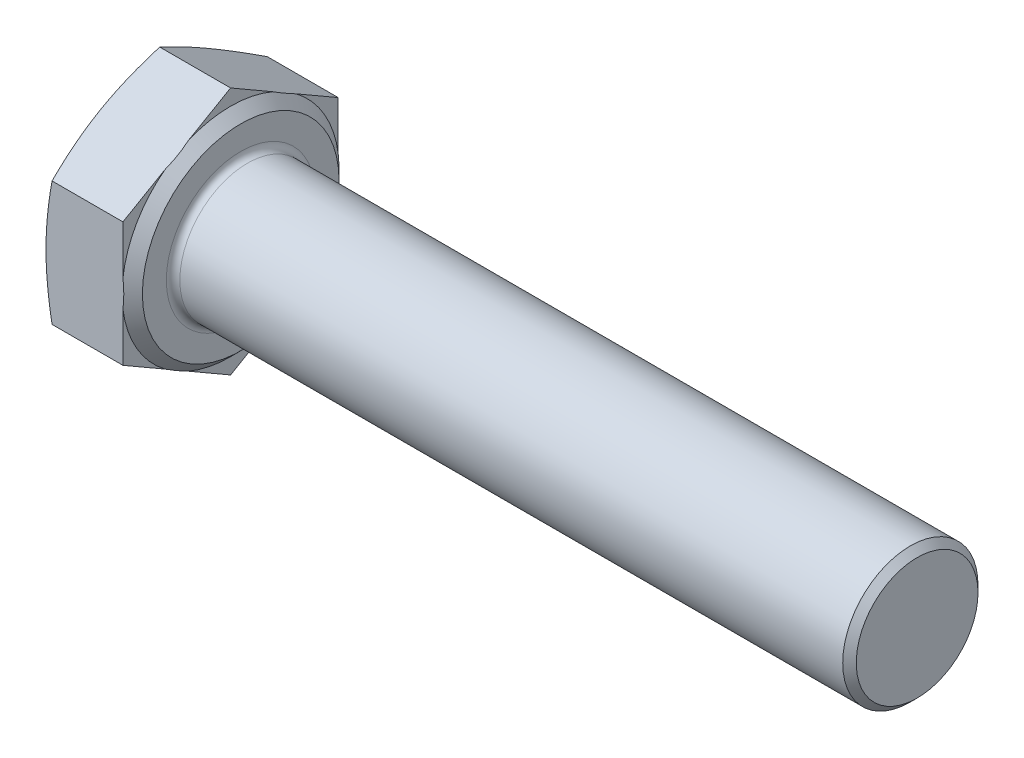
ISO-10303-21;
HEADER;
FILE_DESCRIPTION(('STEP AP214'),'2;1');
FILE_NAME('part.step','',(''),(''),'','','');
FILE_SCHEMA(('AUTOMOTIVE_DESIGN { 1 0 10303 214 1 1 1 1 }'));
ENDSEC;
DATA;
#1=APPLICATION_CONTEXT('core data for automotive mechanical design processes');
#2=APPLICATION_PROTOCOL_DEFINITION('international standard','automotive_design',2000,#1);
#3=PRODUCT_CONTEXT('',#1,'mechanical');
#4=PRODUCT('Part','Part','',(#3));
#5=PRODUCT_RELATED_PRODUCT_CATEGORY('part','',(#4));
#6=PRODUCT_DEFINITION_FORMATION('','',#4);
#7=PRODUCT_DEFINITION_CONTEXT('part definition',#1,'design');
#8=PRODUCT_DEFINITION('design','',#6,#7);
#9=PRODUCT_DEFINITION_SHAPE('','',#8);
#10=(LENGTH_UNIT() NAMED_UNIT(*) SI_UNIT(.MILLI.,.METRE.));
#11=(NAMED_UNIT(*) PLANE_ANGLE_UNIT() SI_UNIT($,.RADIAN.));
#12=(NAMED_UNIT(*) SI_UNIT($,.STERADIAN.) SOLID_ANGLE_UNIT());
#13=UNCERTAINTY_MEASURE_WITH_UNIT(LENGTH_MEASURE(1.E-05),#10,'distance_accuracy_value','');
#14=(GEOMETRIC_REPRESENTATION_CONTEXT(3) GLOBAL_UNCERTAINTY_ASSIGNED_CONTEXT((#13)) GLOBAL_UNIT_ASSIGNED_CONTEXT((#10,
#11,#12)) REPRESENTATION_CONTEXT('',''));
#15=CARTESIAN_POINT('',(0.,0.,0.));
#16=DIRECTION('',(0.,0.,1.));
#17=DIRECTION('',(1.,0.,0.));
#18=AXIS2_PLACEMENT_3D('',#15,#16,#17);
#19=CARTESIAN_POINT('',(5.15,0.,12.73));
#20=DIRECTION('',(-1.,0.,0.));
#21=DIRECTION('',(0.,0.,1.));
#22=AXIS2_PLACEMENT_3D('',#19,#20,#21);
#23=PLANE('',#22);
#24=CARTESIAN_POINT('',(5.15,0.,0.));
#25=DIRECTION('',(-1.,0.,0.));
#26=DIRECTION('',(0.,0.,1.));
#27=AXIS2_PLACEMENT_3D('',#24,#25,#26);
#28=CIRCLE('',#27,4.4);
#29=CARTESIAN_POINT('',(5.15,0.,4.4));
#30=VERTEX_POINT('',#29);
#31=EDGE_CURVE('E11',#30,#30,#28,.T.);
#32=ORIENTED_EDGE('',*,*,#31,.T.);
#33=EDGE_LOOP('',(#32));
#34=FACE_BOUND('',#33,.T.);
#35=CARTESIAN_POINT('',(5.15,0.,0.));
#36=DIRECTION('',(-1.,0.,0.));
#37=DIRECTION('',(0.,0.,1.));
#38=AXIS2_PLACEMENT_3D('',#35,#36,#37);
#39=CIRCLE('',#38,5.815);
#40=CARTESIAN_POINT('',(5.15,0.,5.815));
#41=VERTEX_POINT('',#40);
#42=EDGE_CURVE('E387',#41,#41,#39,.T.);
#43=ORIENTED_EDGE('',*,*,#42,.F.);
#44=EDGE_LOOP('',(#43));
#45=FACE_BOUND('',#44,.T.);
#46=ADVANCED_FACE('F32',(#34,#45),#23,.F.);
#47=CARTESIAN_POINT('',(5.15,-3.67483446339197,6.365));
#48=DIRECTION('',(0.,0.866025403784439,-0.5));
#49=DIRECTION('',(0.,0.5,0.866025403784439));
#50=AXIS2_PLACEMENT_3D('',#47,#48,#49);
#51=PLANE('',#50);
#52=CARTESIAN_POINT('',(0.358432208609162,-7.34978439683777,-0.0002));
#53=CARTESIAN_POINT('',(0.303017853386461,-7.19759190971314,0.263405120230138));
#54=CARTESIAN_POINT('',(0.252608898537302,-7.04489755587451,0.527879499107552));
#55=CARTESIAN_POINT('',(0.163922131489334,-6.73851600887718,1.05854790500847));
#56=CARTESIAN_POINT('',(0.12565381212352,-6.58482813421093,1.3247431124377));
#57=CARTESIAN_POINT('',(0.0637558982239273,-6.27816513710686,1.85589900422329));
#58=CARTESIAN_POINT('',(0.0399912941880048,-6.12519701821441,2.12084755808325));
#59=CARTESIAN_POINT('',(0.00811628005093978,-5.8189030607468,2.65136425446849));
#60=CARTESIAN_POINT('',(0.,-5.66557737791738,2.91693212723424));
#61=CARTESIAN_POINT('',(0.,-5.35892601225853,3.44806787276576));
#62=CARTESIAN_POINT('',(0.00811628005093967,-5.2056003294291,3.71363574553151));
#63=CARTESIAN_POINT('',(0.0399912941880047,-4.89930637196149,4.24415244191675));
#64=CARTESIAN_POINT('',(0.0637558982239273,-4.74633825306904,4.50910099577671));
#65=CARTESIAN_POINT('',(0.12565381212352,-4.43967525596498,5.0402568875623));
#66=CARTESIAN_POINT('',(0.163922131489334,-4.28598738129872,5.30645209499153));
#67=CARTESIAN_POINT('',(0.252608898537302,-3.9796058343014,5.83712050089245));
#68=CARTESIAN_POINT('',(0.303017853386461,-3.82691148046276,6.10159487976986));
#69=CARTESIAN_POINT('',(0.358432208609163,-3.67471899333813,6.3652));
#70=B_SPLINE_CURVE_WITH_KNOTS('',3,(#52,#53,#54,#55,#56,#57,#58,#59,#60,#61,#62,#63,#64,#65,#66,
#67,#68,#69),.UNSPECIFIED.,.F.,.F.,(4,2,2,2,2,2,2,2,4),(0.,0.928259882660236,1.85724379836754,
2.77744274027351,3.69729643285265,4.6171501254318,5.53734906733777,6.46633298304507,
7.39459286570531),.UNSPECIFIED.);
#71=CARTESIAN_POINT('',(0.358390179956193,-7.34966892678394,0.));
#72=VERTEX_POINT('',#71);
#73=CARTESIAN_POINT('',(0.,-5.51225169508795,3.1825));
#74=VERTEX_POINT('',#73);
#75=EDGE_CURVE('E420',#72,#74,#70,.T.);
#76=ORIENTED_EDGE('',*,*,#75,.F.);
#77=DIRECTION('',(-1.,0.,0.));
#78=VECTOR('',#77,1.);
#79=CARTESIAN_POINT('',(5.15,-7.34966892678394,0.));
#80=LINE('',#79,#78);
#81=CARTESIAN_POINT('',(4.55,-7.34966892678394,0.));
#82=VERTEX_POINT('',#81);
#83=EDGE_CURVE('E182',#82,#72,#80,.T.);
#84=ORIENTED_EDGE('',*,*,#83,.F.);
#85=DIRECTION('',(0.,-0.5,-0.866025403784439));
#86=VECTOR('',#85,1.);
#87=CARTESIAN_POINT('',(4.55,-3.67483446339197,6.365));
#88=LINE('',#87,#86);
#89=CARTESIAN_POINT('',(4.55,-5.9119390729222,2.4902211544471));
#90=VERTEX_POINT('',#89);
#91=EDGE_CURVE('E173',#90,#82,#88,.T.);
#92=ORIENTED_EDGE('',*,*,#91,.F.);
#93=CARTESIAN_POINT('',(4.54979999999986,-5.11176260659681,3.87616744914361));
#94=CARTESIAN_POINT('',(4.56645104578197,-5.17829348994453,3.76093257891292));
#95=CARTESIAN_POINT('',(4.57901760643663,-5.24508569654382,3.64524508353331));
#96=CARTESIAN_POINT('',(4.59577584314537,-5.37866984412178,3.41387055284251));
#97=CARTESIAN_POINT('',(4.59999999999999,-5.44546076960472,3.2981852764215));
#98=CARTESIAN_POINT('',(4.60000000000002,-5.57904262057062,3.06681472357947));
#99=CARTESIAN_POINT('',(4.59577584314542,-5.64583354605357,2.95112944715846));
#100=CARTESIAN_POINT('',(4.57901760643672,-5.77941769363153,2.71975491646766));
#101=CARTESIAN_POINT('',(4.56645104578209,-5.84620990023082,2.60406742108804));
#102=CARTESIAN_POINT('',(4.5498,-5.91274078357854,2.48883255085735));
#103=B_SPLINE_CURVE_WITH_KNOTS('',3,(#93,#94,#95,#96,#97,#98,#99,#100,#101,#102),.UNSPECIFIED.,
.F.,.F.,(4,2,2,2,4),(0.,0.402253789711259,0.802938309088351,1.20362282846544,1.6058766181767),.UNSPECIFIED.);
#104=CARTESIAN_POINT('',(4.55,-5.1125643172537,3.8747788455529));
#105=VERTEX_POINT('',#104);
#106=EDGE_CURVE('E297',#105,#90,#103,.T.);
#107=ORIENTED_EDGE('',*,*,#106,.F.);
#108=CARTESIAN_POINT('',(4.55,-3.67483446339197,6.365));
#109=VERTEX_POINT('',#108);
#110=EDGE_CURVE('E354',#109,#105,#88,.T.);
#111=ORIENTED_EDGE('',*,*,#110,.F.);
#112=DIRECTION('',(-1.,0.,0.));
#113=VECTOR('',#112,1.);
#114=CARTESIAN_POINT('',(5.15,-3.67483446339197,6.365));
#115=LINE('',#114,#113);
#116=CARTESIAN_POINT('',(0.358390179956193,-3.67483446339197,6.365));
#117=VERTEX_POINT('',#116);
#118=EDGE_CURVE('E168',#109,#117,#115,.T.);
#119=ORIENTED_EDGE('',*,*,#118,.T.);
#120=EDGE_CURVE('E161',#74,#117,#70,.T.);
#121=ORIENTED_EDGE('',*,*,#120,.F.);
#122=EDGE_LOOP('',(#76,#84,#92,#107,#111,#119,#121));
#123=FACE_BOUND('',#122,.T.);
#124=ADVANCED_FACE('F34',(#123),#51,.F.);
#125=CARTESIAN_POINT('',(5.15,-7.34966892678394,0.));
#126=DIRECTION('',(0.,0.866025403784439,0.5));
#127=DIRECTION('',(0.,-0.5,0.866025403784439));
#128=AXIS2_PLACEMENT_3D('',#125,#126,#127);
#129=PLANE('',#128);
#130=CARTESIAN_POINT('',(0.358432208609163,-3.67471899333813,-6.3652));
#131=CARTESIAN_POINT('',(0.303017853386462,-3.82691148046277,-6.10159487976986));
#132=CARTESIAN_POINT('',(0.252608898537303,-3.9796058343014,-5.83712050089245));
#133=CARTESIAN_POINT('',(0.163922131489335,-4.28598738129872,-5.30645209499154));
#134=CARTESIAN_POINT('',(0.125653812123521,-4.43967525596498,-5.0402568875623));
#135=CARTESIAN_POINT('',(0.063755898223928,-4.74633825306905,-4.50910099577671));
#136=CARTESIAN_POINT('',(0.0399912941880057,-4.8993063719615,-4.24415244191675));
#137=CARTESIAN_POINT('',(0.00811628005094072,-5.2056003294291,-3.71363574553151));
#138=CARTESIAN_POINT('',(0.,-5.35892601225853,-3.44806787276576));
#139=CARTESIAN_POINT('',(0.,-5.66557737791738,-2.91693212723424));
#140=CARTESIAN_POINT('',(0.00811628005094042,-5.81890306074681,-2.65136425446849));
#141=CARTESIAN_POINT('',(0.0399912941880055,-6.12519701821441,-2.12084755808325));
#142=CARTESIAN_POINT('',(0.0637558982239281,-6.27816513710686,-1.85589900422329));
#143=CARTESIAN_POINT('',(0.125653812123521,-6.58482813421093,-1.3247431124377));
#144=CARTESIAN_POINT('',(0.163922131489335,-6.73851600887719,-1.05854790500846));
#145=CARTESIAN_POINT('',(0.252608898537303,-7.04489755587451,-0.527879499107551));
#146=CARTESIAN_POINT('',(0.303017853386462,-7.19759190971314,-0.263405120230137));
#147=CARTESIAN_POINT('',(0.358432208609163,-7.34978439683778,0.000200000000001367));
#148=B_SPLINE_CURVE_WITH_KNOTS('',3,(#130,#131,#132,#133,#134,#135,#136,#137,#138,#139,#140,
#141,#142,#143,#144,#145,#146,#147),.UNSPECIFIED.,.F.,.F.,(4,2,2,2,2,2,2,2,4),(0.,
0.928259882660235,1.85724379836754,2.77744274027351,3.69729643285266,4.6171501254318,
5.53734906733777,6.46633298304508,7.39459286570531),.UNSPECIFIED.);
#149=CARTESIAN_POINT('',(0.358390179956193,-3.67483446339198,-6.365));
#150=VERTEX_POINT('',#149);
#151=CARTESIAN_POINT('',(0.,-5.51225169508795,-3.1825));
#152=VERTEX_POINT('',#151);
#153=EDGE_CURVE('E277',#150,#152,#148,.T.);
#154=ORIENTED_EDGE('',*,*,#153,.F.);
#155=DIRECTION('',(-1.,0.,0.));
#156=VECTOR('',#155,1.);
#157=CARTESIAN_POINT('',(5.15,-3.67483446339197,-6.365));
#158=LINE('',#157,#156);
#159=CARTESIAN_POINT('',(4.55,-3.67483446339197,-6.365));
#160=VERTEX_POINT('',#159);
#161=EDGE_CURVE('E179',#160,#150,#158,.T.);
#162=ORIENTED_EDGE('',*,*,#161,.F.);
#163=DIRECTION('',(0.,0.5,-0.866025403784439));
#164=VECTOR('',#163,1.);
#165=CARTESIAN_POINT('',(4.55,-7.34966892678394,0.));
#166=LINE('',#165,#164);
#167=CARTESIAN_POINT('',(4.55,-5.11256431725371,-3.87477884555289));
#168=VERTEX_POINT('',#167);
#169=EDGE_CURVE('E358',#168,#160,#166,.T.);
#170=ORIENTED_EDGE('',*,*,#169,.F.);
#171=CARTESIAN_POINT('',(4.5498,-5.91274078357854,-2.48883255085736));
#172=CARTESIAN_POINT('',(4.56645104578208,-5.84620990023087,-2.60406742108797));
#173=CARTESIAN_POINT('',(4.5790176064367,-5.77941769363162,-2.7197549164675));
#174=CARTESIAN_POINT('',(4.5957758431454,-5.64583354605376,-2.95112944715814));
#175=CARTESIAN_POINT('',(4.6,-5.57904262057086,-3.06681472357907));
#176=CARTESIAN_POINT('',(4.6,-5.44546076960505,-3.29818527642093));
#177=CARTESIAN_POINT('',(4.5957758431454,-5.37866984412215,-3.41387055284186));
#178=CARTESIAN_POINT('',(4.5790176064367,-5.24508569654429,-3.64524508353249));
#179=CARTESIAN_POINT('',(4.56645104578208,-5.17829348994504,-3.76093257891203));
#180=CARTESIAN_POINT('',(4.5498,-5.11176260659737,-3.87616744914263));
#181=B_SPLINE_CURVE_WITH_KNOTS('',3,(#171,#172,#173,#174,#175,#176,#177,#178,#179,#180),
.UNSPECIFIED.,.F.,.F.,(4,2,2,2,4),(0.,0.402253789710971,0.802938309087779,1.20362282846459,
1.60587661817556),.UNSPECIFIED.);
#182=CARTESIAN_POINT('',(4.55,-5.9119390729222,-2.49022115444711));
#183=VERTEX_POINT('',#182);
#184=EDGE_CURVE('E291',#183,#168,#181,.T.);
#185=ORIENTED_EDGE('',*,*,#184,.F.);
#186=EDGE_CURVE('E359',#82,#183,#166,.T.);
#187=ORIENTED_EDGE('',*,*,#186,.F.);
#188=ORIENTED_EDGE('',*,*,#83,.T.);
#189=EDGE_CURVE('E273',#152,#72,#148,.T.);
#190=ORIENTED_EDGE('',*,*,#189,.F.);
#191=EDGE_LOOP('',(#154,#162,#170,#185,#187,#188,#190));
#192=FACE_BOUND('',#191,.T.);
#193=ADVANCED_FACE('F219',(#192),#129,.F.);
#194=CARTESIAN_POINT('',(5.15,-3.67483446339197,-6.365));
#195=DIRECTION('',(0.,0.,1.));
#196=DIRECTION('',(0.,-1.,0.));
#197=AXIS2_PLACEMENT_3D('',#194,#195,#196);
#198=PLANE('',#197);
#199=CARTESIAN_POINT('',(1.9150953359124,-9.72967062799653,-6.365));
#200=CARTESIAN_POINT('',(1.82740685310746,-9.44169496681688,-6.365));
#201=CARTESIAN_POINT('',(1.74074158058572,-9.15340194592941,-6.365));
#202=CARTESIAN_POINT('',(1.57002349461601,-8.57601961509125,-6.365));
#203=CARTESIAN_POINT('',(1.48597088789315,-8.28693024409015,-6.365));
#204=CARTESIAN_POINT('',(1.320904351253,-7.70729883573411,-6.365));
#205=CARTESIAN_POINT('',(1.23989638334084,-7.41675509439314,-6.365));
#206=CARTESIAN_POINT('',(1.08186750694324,-6.83458682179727,-6.365));
#207=CARTESIAN_POINT('',(1.0048465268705,-6.54296231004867,-6.365));
#208=CARTESIAN_POINT('',(0.856698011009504,-5.96204179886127,-6.365));
#209=CARTESIAN_POINT('',(0.785509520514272,-5.67276142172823,-6.365));
#210=CARTESIAN_POINT('',(0.649193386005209,-5.09276117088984,-6.365));
#211=CARTESIAN_POINT('',(0.584065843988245,-4.80204127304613,-6.365));
#212=CARTESIAN_POINT('',(0.46138999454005,-4.21909692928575,-6.365));
#213=CARTESIAN_POINT('',(0.40383910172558,-3.92687303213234,-6.365));
#214=CARTESIAN_POINT('',(0.298068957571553,-3.34072867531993,-6.365));
#215=CARTESIAN_POINT('',(0.249849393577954,-3.04680827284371,-6.365));
#216=CARTESIAN_POINT('',(0.169475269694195,-2.49036754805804,-6.365));
#217=CARTESIAN_POINT('',(0.136125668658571,-2.22802146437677,-6.365));
#218=CARTESIAN_POINT('',(0.0796727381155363,-1.70221996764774,-6.365));
#219=CARTESIAN_POINT('',(0.0565691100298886,-1.43876458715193,-6.365));
#220=CARTESIAN_POINT('',(0.0217207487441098,-0.911278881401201,-6.365));
#221=CARTESIAN_POINT('',(0.00996798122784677,-0.647249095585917,-6.365));
#222=CARTESIAN_POINT('',(-0.00158361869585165,-0.118925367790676,-6.365));
#223=CARTESIAN_POINT('',(-0.00138253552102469,0.145368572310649,-6.365));
#224=CARTESIAN_POINT('',(0.0109939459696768,0.675012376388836,-6.365));
#225=CARTESIAN_POINT('',(0.0232300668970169,0.940360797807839,-6.365));
#226=CARTESIAN_POINT('',(0.0591135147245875,1.47027824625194,-6.365));
#227=CARTESIAN_POINT('',(0.0827611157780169,1.73484725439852,-6.365));
#228=CARTESIAN_POINT('',(0.140361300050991,2.26307523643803,-6.365));
#229=CARTESIAN_POINT('',(0.174322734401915,2.52673323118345,-6.365));
#230=CARTESIAN_POINT('',(0.251173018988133,3.05273020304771,-6.365));
#231=CARTESIAN_POINT('',(0.294061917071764,3.31506917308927,-6.365));
#232=CARTESIAN_POINT('',(0.389839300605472,3.85223310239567,-6.365));
#233=CARTESIAN_POINT('',(0.443136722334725,4.12698449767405,-6.365));
#234=CARTESIAN_POINT('',(0.556591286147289,4.67507636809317,-6.365));
#235=CARTESIAN_POINT('',(0.616748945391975,4.94841673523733,-6.365));
#236=CARTESIAN_POINT('',(0.74266069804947,5.49388136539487,-6.365));
#237=CARTESIAN_POINT('',(0.808416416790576,5.76600525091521,-6.365));
#238=CARTESIAN_POINT('',(0.944454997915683,6.30910658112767,-6.365));
#239=CARTESIAN_POINT('',(1.01473775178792,6.5800840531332,-6.365));
#240=CARTESIAN_POINT('',(1.15907513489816,7.12140033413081,-6.365));
#241=CARTESIAN_POINT('',(1.23313447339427,7.39173788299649,-6.365));
#242=CARTESIAN_POINT('',(1.38427063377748,7.93156975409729,-6.365));
#243=CARTESIAN_POINT('',(1.46134750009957,8.20106406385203,-6.365));
#244=CARTESIAN_POINT('',(1.69623888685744,9.00837522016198,-6.365));
#245=CARTESIAN_POINT('',(1.85774082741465,9.54511848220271,-6.365));
#246=CARTESIAN_POINT('',(2.18566531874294,10.6106004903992,-6.365));
#247=CARTESIAN_POINT('',(2.35201388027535,11.1393621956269,-6.365));
#248=CARTESIAN_POINT('',(2.68943698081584,12.1954003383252,-6.365));
#249=CARTESIAN_POINT('',(2.86051174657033,12.7226767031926,-6.365));
#250=CARTESIAN_POINT('',(3.20545948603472,13.7740950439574,-6.365));
#251=CARTESIAN_POINT('',(3.37931937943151,14.298241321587,-6.365));
#252=CARTESIAN_POINT('',(3.64203864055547,15.0837906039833,-6.365));
#253=CARTESIAN_POINT('',(3.72992971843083,15.3455181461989,-6.365));
#254=CARTESIAN_POINT('',(3.90628058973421,15.8687808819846,-6.365));
#255=CARTESIAN_POINT('',(3.99474038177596,16.1303160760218,-6.365));
#256=CARTESIAN_POINT('',(4.08344640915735,16.3917677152,-6.365));
#257=B_SPLINE_CURVE_WITH_KNOTS('',3,(#199,#200,#201,#202,#203,#204,#205,#206,#207,#208,#209,
#210,#211,#212,#213,#214,#215,#216,#217,#218,#219,#220,#221,#222,#223,#224,#225,#226,#227,#228,
#229,#230,#231,#232,#233,#234,#235,#236,#237,#238,#239,#240,#241,#242,#243,#244,#245,#246,#247,
#248,#249,#250,#251,#252,#253,#254,#255,#256),.UNSPECIFIED.,.F.,.F.,(4,2,2,2,2,2,2,2,2,2,2,2,2,
2,2,2,2,2,2,2,2,2,2,2,2,2,2,2,4),(0.,0.903097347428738,1.8062659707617,2.71111968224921,
3.61595714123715,4.50963841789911,5.4033347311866,6.29672529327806,7.19008591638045,
7.98328363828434,8.77645824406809,9.56907101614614,10.3616781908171,11.1583050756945,
11.9549510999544,12.7522827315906,13.5496186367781,14.3891305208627,15.2287057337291,
16.0685255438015,16.9083252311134,17.7491990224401,18.5900852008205,20.271552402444,
21.9344598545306,23.5974472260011,25.2541246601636,26.0823966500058,26.910666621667),.UNSPECIFIED.);
#258=CARTESIAN_POINT('',(0.358390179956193,3.67483446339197,-6.365));
#259=VERTEX_POINT('',#258);
#260=CARTESIAN_POINT('',(0.,0.,-6.365));
#261=VERTEX_POINT('',#260);
#262=EDGE_CURVE('E426',#259,#261,#257,.F.);
#263=ORIENTED_EDGE('',*,*,#262,.F.);
#264=DIRECTION('',(-1.,0.,0.));
#265=VECTOR('',#264,1.);
#266=CARTESIAN_POINT('',(5.15,3.67483446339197,-6.365));
#267=LINE('',#266,#265);
#268=CARTESIAN_POINT('',(4.55,3.67483446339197,-6.365));
#269=VERTEX_POINT('',#268);
#270=EDGE_CURVE('E170',#269,#259,#267,.T.);
#271=ORIENTED_EDGE('',*,*,#270,.F.);
#272=DIRECTION('',(0.,1.,0.));
#273=VECTOR('',#272,1.);
#274=CARTESIAN_POINT('',(4.55,-3.67483446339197,-6.365));
#275=LINE('',#274,#273);
#276=CARTESIAN_POINT('',(4.55,0.799374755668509,-6.365));
#277=VERTEX_POINT('',#276);
#278=EDGE_CURVE('E356',#277,#269,#275,.T.);
#279=ORIENTED_EDGE('',*,*,#278,.F.);
#280=CARTESIAN_POINT('',(3.73279951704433,-3.43387519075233,-6.365));
#281=CARTESIAN_POINT('',(3.82915263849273,-3.23085023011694,-6.365));
#282=CARTESIAN_POINT('',(3.92025748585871,-3.02511909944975,-6.365));
#283=CARTESIAN_POINT('',(4.08924442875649,-2.607586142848,-6.365));
#284=CARTESIAN_POINT('',(4.16708471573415,-2.39576749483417,-6.365));
#285=CARTESIAN_POINT('',(4.30570873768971,-1.96811964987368,-6.365));
#286=CARTESIAN_POINT('',(4.36660505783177,-1.75232760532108,-6.365));
#287=CARTESIAN_POINT('',(4.46875528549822,-1.31633465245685,-6.365));
#288=CARTESIAN_POINT('',(4.51003455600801,-1.09613982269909,-6.365));
#289=CARTESIAN_POINT('',(4.56166598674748,-0.716857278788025,-6.365));
#290=CARTESIAN_POINT('',(4.57750915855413,-0.558507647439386,-6.365));
#291=CARTESIAN_POINT('',(4.59740688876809,-0.241033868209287,-6.365));
#292=CARTESIAN_POINT('',(4.60146005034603,-0.0819096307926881,-6.365));
#293=CARTESIAN_POINT('',(4.59760366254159,0.236307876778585,-6.365));
#294=CARTESIAN_POINT('',(4.5896854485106,0.395401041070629,-6.365));
#295=CARTESIAN_POINT('',(4.56219166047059,0.712536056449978,-6.365));
#296=CARTESIAN_POINT('',(4.54261749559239,0.870578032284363,-6.365));
#297=CARTESIAN_POINT('',(4.47989629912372,1.26397857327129,-6.365));
#298=CARTESIAN_POINT('',(4.42984501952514,1.49825109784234,-6.365));
#299=CARTESIAN_POINT('',(4.30840439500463,1.9614286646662,-6.365));
#300=CARTESIAN_POINT('',(4.23698240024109,2.19032491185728,-6.365));
#301=CARTESIAN_POINT('',(4.07639278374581,2.64284924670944,-6.365));
#302=CARTESIAN_POINT('',(3.98714977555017,2.866450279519,-6.365));
#303=CARTESIAN_POINT('',(3.84298757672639,3.1968115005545,-6.365));
#304=CARTESIAN_POINT('',(3.79331043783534,3.30591051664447,-6.365));
#305=CARTESIAN_POINT('',(3.69087238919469,3.52261302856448,-6.365));
#306=CARTESIAN_POINT('',(3.63811240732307,3.63021696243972,-6.365));
#307=CARTESIAN_POINT('',(3.58398571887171,3.73713082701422,-6.365));
#308=B_SPLINE_CURVE_WITH_KNOTS('',3,(#280,#281,#282,#283,#284,#285,#286,#287,#288,#289,#290,
#291,#292,#293,#294,#295,#296,#297,#298,#299,#300,#301,#302,#303,#304,#305,#306,#307),
.UNSPECIFIED.,.F.,.F.,(4,2,2,2,2,2,2,2,2,2,2,2,2,4),(0.,0.674405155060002,1.35089815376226,
2.02278254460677,2.69379587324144,3.17081389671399,3.64788843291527,4.1253084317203,
4.60267072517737,5.32008921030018,6.03860940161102,6.76023604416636,7.11982798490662,
7.4793122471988),.UNSPECIFIED.);
#309=CARTESIAN_POINT('',(4.55,-0.799374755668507,-6.365));
#310=VERTEX_POINT('',#309);
#311=EDGE_CURVE('E298',#310,#277,#308,.T.);
#312=ORIENTED_EDGE('',*,*,#311,.F.);
#313=EDGE_CURVE('E357',#160,#310,#275,.T.);
#314=ORIENTED_EDGE('',*,*,#313,.F.);
#315=ORIENTED_EDGE('',*,*,#161,.T.);
#316=EDGE_CURVE('E278',#261,#150,#257,.F.);
#317=ORIENTED_EDGE('',*,*,#316,.F.);
#318=EDGE_LOOP('',(#263,#271,#279,#312,#314,#315,#317));
#319=FACE_BOUND('',#318,.T.);
#320=ADVANCED_FACE('F286',(#319),#198,.F.);
#321=CARTESIAN_POINT('',(5.15,3.67483446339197,-6.365));
#322=DIRECTION('',(0.,-0.866025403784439,0.5));
#323=DIRECTION('',(0.,-0.5,-0.866025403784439));
#324=AXIS2_PLACEMENT_3D('',#321,#322,#323);
#325=PLANE('',#324);
#326=CARTESIAN_POINT('',(0.358432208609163,7.34978439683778,0.000199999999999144));
#327=CARTESIAN_POINT('',(0.303017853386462,7.19759190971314,-0.26340512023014));
#328=CARTESIAN_POINT('',(0.252608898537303,7.04489755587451,-0.527879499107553));
#329=CARTESIAN_POINT('',(0.163922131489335,6.73851600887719,-1.05854790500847));
#330=CARTESIAN_POINT('',(0.125653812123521,6.58482813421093,-1.3247431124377));
#331=CARTESIAN_POINT('',(0.0637558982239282,6.27816513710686,-1.85589900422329));
#332=CARTESIAN_POINT('',(0.0399912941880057,6.12519701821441,-2.12084755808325));
#333=CARTESIAN_POINT('',(0.00811628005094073,5.81890306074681,-2.65136425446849));
#334=CARTESIAN_POINT('',(0.,5.66557737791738,-2.91693212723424));
#335=CARTESIAN_POINT('',(0.,5.35892601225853,-3.44806787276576));
#336=CARTESIAN_POINT('',(0.00811628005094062,5.2056003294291,-3.71363574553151));
#337=CARTESIAN_POINT('',(0.0399912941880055,4.89930637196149,-4.24415244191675));
#338=CARTESIAN_POINT('',(0.063755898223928,4.74633825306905,-4.50910099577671));
#339=CARTESIAN_POINT('',(0.125653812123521,4.43967525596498,-5.0402568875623));
#340=CARTESIAN_POINT('',(0.163922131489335,4.28598738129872,-5.30645209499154));
#341=CARTESIAN_POINT('',(0.252608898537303,3.9796058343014,-5.83712050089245));
#342=CARTESIAN_POINT('',(0.303017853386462,3.82691148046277,-6.10159487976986));
#343=CARTESIAN_POINT('',(0.358432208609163,3.67471899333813,-6.3652));
#344=B_SPLINE_CURVE_WITH_KNOTS('',3,(#326,#327,#328,#329,#330,#331,#332,#333,#334,#335,#336,
#337,#338,#339,#340,#341,#342,#343),.UNSPECIFIED.,.F.,.F.,(4,2,2,2,2,2,2,2,4),(0.,
0.928259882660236,1.85724379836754,2.77744274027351,3.69729643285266,4.6171501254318,
5.53734906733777,6.46633298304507,7.39459286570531),.UNSPECIFIED.);
#345=CARTESIAN_POINT('',(0.358390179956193,7.34966892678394,0.));
#346=VERTEX_POINT('',#345);
#347=CARTESIAN_POINT('',(0.,5.51225169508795,-3.1825));
#348=VERTEX_POINT('',#347);
#349=EDGE_CURVE('E268',#346,#348,#344,.T.);
#350=ORIENTED_EDGE('',*,*,#349,.F.);
#351=DIRECTION('',(-1.,0.,0.));
#352=VECTOR('',#351,1.);
#353=CARTESIAN_POINT('',(5.15,7.34966892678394,0.));
#354=LINE('',#353,#352);
#355=CARTESIAN_POINT('',(4.55,7.34966892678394,0.));
#356=VERTEX_POINT('',#355);
#357=EDGE_CURVE('E167',#356,#346,#354,.T.);
#358=ORIENTED_EDGE('',*,*,#357,.F.);
#359=DIRECTION('',(0.,0.5,0.866025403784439));
#360=VECTOR('',#359,1.);
#361=CARTESIAN_POINT('',(4.55,3.67483446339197,-6.365));
#362=LINE('',#361,#360);
#363=CARTESIAN_POINT('',(4.55,5.9119390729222,-2.49022115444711));
#364=VERTEX_POINT('',#363);
#365=EDGE_CURVE('E349',#364,#356,#362,.T.);
#366=ORIENTED_EDGE('',*,*,#365,.F.);
#367=CARTESIAN_POINT('',(4.5498,5.11176260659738,-3.87616744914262));
#368=CARTESIAN_POINT('',(4.56645104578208,5.17829348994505,-3.76093257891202));
#369=CARTESIAN_POINT('',(4.5790176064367,5.2450856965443,-3.64524508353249));
#370=CARTESIAN_POINT('',(4.5957758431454,5.37866984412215,-3.41387055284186));
#371=CARTESIAN_POINT('',(4.6,5.44546076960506,-3.29818527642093));
#372=CARTESIAN_POINT('',(4.6,5.57904262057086,-3.06681472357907));
#373=CARTESIAN_POINT('',(4.5957758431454,5.64583354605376,-2.95112944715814));
#374=CARTESIAN_POINT('',(4.5790176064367,5.77941769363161,-2.71975491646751));
#375=CARTESIAN_POINT('',(4.56645104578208,5.84620990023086,-2.60406742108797));
#376=CARTESIAN_POINT('',(4.5498,5.91274078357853,-2.48883255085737));
#377=B_SPLINE_CURVE_WITH_KNOTS('',3,(#367,#368,#369,#370,#371,#372,#373,#374,#375,#376),
.UNSPECIFIED.,.F.,.F.,(4,2,2,2,4),(0.,0.402253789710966,0.802938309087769,1.20362282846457,
1.60587661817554),.UNSPECIFIED.);
#378=CARTESIAN_POINT('',(4.55,5.11256431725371,-3.87477884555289));
#379=VERTEX_POINT('',#378);
#380=EDGE_CURVE('E322',#379,#364,#377,.T.);
#381=ORIENTED_EDGE('',*,*,#380,.F.);
#382=EDGE_CURVE('E352',#269,#379,#362,.T.);
#383=ORIENTED_EDGE('',*,*,#382,.F.);
#384=ORIENTED_EDGE('',*,*,#270,.T.);
#385=EDGE_CURVE('E340',#348,#259,#344,.T.);
#386=ORIENTED_EDGE('',*,*,#385,.F.);
#387=EDGE_LOOP('',(#350,#358,#366,#381,#383,#384,#386));
#388=FACE_BOUND('',#387,.T.);
#389=ADVANCED_FACE('F326',(#388),#325,.F.);
#390=CARTESIAN_POINT('',(5.15,7.34966892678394,0.));
#391=DIRECTION('',(0.,-0.866025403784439,-0.5));
#392=DIRECTION('',(0.,0.5,-0.866025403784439));
#393=AXIS2_PLACEMENT_3D('',#390,#391,#392);
#394=PLANE('',#393);
#395=CARTESIAN_POINT('',(0.358432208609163,3.67471899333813,6.3652));
#396=CARTESIAN_POINT('',(0.303017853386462,3.82691148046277,6.10159487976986));
#397=CARTESIAN_POINT('',(0.252608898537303,3.9796058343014,5.83712050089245));
#398=CARTESIAN_POINT('',(0.163922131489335,4.28598738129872,5.30645209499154));
#399=CARTESIAN_POINT('',(0.125653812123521,4.43967525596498,5.0402568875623));
#400=CARTESIAN_POINT('',(0.0637558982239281,4.74633825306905,4.50910099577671));
#401=CARTESIAN_POINT('',(0.0399912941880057,4.8993063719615,4.24415244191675));
#402=CARTESIAN_POINT('',(0.00811628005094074,5.2056003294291,3.71363574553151));
#403=CARTESIAN_POINT('',(0.,5.35892601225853,3.44806787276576));
#404=CARTESIAN_POINT('',(0.,5.66557737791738,2.91693212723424));
#405=CARTESIAN_POINT('',(0.00811628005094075,5.81890306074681,2.65136425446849));
#406=CARTESIAN_POINT('',(0.0399912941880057,6.12519701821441,2.12084755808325));
#407=CARTESIAN_POINT('',(0.063755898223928,6.27816513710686,1.85589900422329));
#408=CARTESIAN_POINT('',(0.125653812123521,6.58482813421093,1.3247431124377));
#409=CARTESIAN_POINT('',(0.163922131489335,6.73851600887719,1.05854790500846));
#410=CARTESIAN_POINT('',(0.252608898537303,7.04489755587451,0.527879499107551));
#411=CARTESIAN_POINT('',(0.303017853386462,7.19759190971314,0.263405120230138));
#412=CARTESIAN_POINT('',(0.358432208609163,7.34978439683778,-0.000200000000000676));
#413=B_SPLINE_CURVE_WITH_KNOTS('',3,(#395,#396,#397,#398,#399,#400,#401,#402,#403,#404,#405,
#406,#407,#408,#409,#410,#411,#412),.UNSPECIFIED.,.F.,.F.,(4,2,2,2,2,2,2,2,4),(0.,
0.928259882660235,1.85724379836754,2.77744274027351,3.69729643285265,4.6171501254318,
5.53734906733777,6.46633298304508,7.39459286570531),.UNSPECIFIED.);
#414=CARTESIAN_POINT('',(0.358390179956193,3.67483446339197,6.365));
#415=VERTEX_POINT('',#414);
#416=CARTESIAN_POINT('',(0.,5.51225169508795,3.1825));
#417=VERTEX_POINT('',#416);
#418=EDGE_CURVE('E145',#415,#417,#413,.T.);
#419=ORIENTED_EDGE('',*,*,#418,.F.);
#420=DIRECTION('',(-1.,0.,0.));
#421=VECTOR('',#420,1.);
#422=CARTESIAN_POINT('',(5.15,3.67483446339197,6.365));
#423=LINE('',#422,#421);
#424=CARTESIAN_POINT('',(4.55,3.67483446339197,6.365));
#425=VERTEX_POINT('',#424);
#426=EDGE_CURVE('E158',#425,#415,#423,.T.);
#427=ORIENTED_EDGE('',*,*,#426,.F.);
#428=DIRECTION('',(0.,-0.5,0.866025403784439));
#429=VECTOR('',#428,1.);
#430=CARTESIAN_POINT('',(4.55,7.34966892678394,0.));
#431=LINE('',#430,#429);
#432=CARTESIAN_POINT('',(4.55,5.11256431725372,3.87477884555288));
#433=VERTEX_POINT('',#432);
#434=EDGE_CURVE('E350',#433,#425,#431,.T.);
#435=ORIENTED_EDGE('',*,*,#434,.F.);
#436=CARTESIAN_POINT('',(4.5498,5.91274078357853,2.48883255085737));
#437=CARTESIAN_POINT('',(4.56645104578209,5.84620990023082,2.60406742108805));
#438=CARTESIAN_POINT('',(4.57901760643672,5.77941769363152,2.71975491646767));
#439=CARTESIAN_POINT('',(4.59577584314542,5.64583354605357,2.95112944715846));
#440=CARTESIAN_POINT('',(4.60000000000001,5.57904262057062,3.06681472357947));
#441=CARTESIAN_POINT('',(4.59999999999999,5.44546076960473,3.2981852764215));
#442=CARTESIAN_POINT('',(4.59577584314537,5.37866984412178,3.41387055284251));
#443=CARTESIAN_POINT('',(4.57901760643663,5.24508569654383,3.6452450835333));
#444=CARTESIAN_POINT('',(4.56645104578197,5.17829348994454,3.76093257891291));
#445=CARTESIAN_POINT('',(4.54979999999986,5.11176260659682,3.87616744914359));
#446=B_SPLINE_CURVE_WITH_KNOTS('',3,(#436,#437,#438,#439,#440,#441,#442,#443,#444,#445),
.UNSPECIFIED.,.F.,.F.,(4,2,2,2,4),(0.,0.402253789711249,0.802938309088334,1.20362282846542,
1.60587661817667),.UNSPECIFIED.);
#447=CARTESIAN_POINT('',(4.55,5.91193907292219,2.49022115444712));
#448=VERTEX_POINT('',#447);
#449=EDGE_CURVE('E317',#448,#433,#446,.T.);
#450=ORIENTED_EDGE('',*,*,#449,.F.);
#451=EDGE_CURVE('E345',#356,#448,#431,.T.);
#452=ORIENTED_EDGE('',*,*,#451,.F.);
#453=ORIENTED_EDGE('',*,*,#357,.T.);
#454=EDGE_CURVE('E160',#417,#346,#413,.T.);
#455=ORIENTED_EDGE('',*,*,#454,.F.);
#456=EDGE_LOOP('',(#419,#427,#435,#450,#452,#453,#455));
#457=FACE_BOUND('',#456,.T.);
#458=ADVANCED_FACE('F156',(#457),#394,.F.);
#459=CARTESIAN_POINT('',(5.15,3.67483446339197,6.365));
#460=DIRECTION('',(0.,0.,-1.));
#461=DIRECTION('',(-1.,0.,0.));
#462=AXIS2_PLACEMENT_3D('',#459,#460,#461);
#463=PLANE('',#462);
#464=CARTESIAN_POINT('',(1.91509499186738,-9.72966949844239,6.365));
#465=CARTESIAN_POINT('',(1.8274065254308,-9.44169388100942,6.365));
#466=CARTESIAN_POINT('',(1.74074126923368,-9.15340090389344,6.365));
#467=CARTESIAN_POINT('',(1.57002321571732,-8.57601866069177,6.365));
#468=CARTESIAN_POINT('',(1.48597062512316,-8.28692933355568,6.365));
#469=CARTESIAN_POINT('',(1.32090412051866,-7.70729801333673,6.365));
#470=CARTESIAN_POINT('',(1.23989616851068,-7.41675431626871,6.365));
#471=CARTESIAN_POINT('',(1.08186732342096,-6.83458613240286,6.365));
#472=CARTESIAN_POINT('',(1.00484635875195,-6.54296166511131,6.365));
#473=CARTESIAN_POINT('',(0.856697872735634,-5.96204124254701,6.365));
#474=CARTESIAN_POINT('',(0.78550939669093,-5.6727609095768,6.365));
#475=CARTESIAN_POINT('',(0.649193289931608,-5.09276074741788,6.365));
#476=CARTESIAN_POINT('',(0.584065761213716,-4.80204089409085,6.365));
#477=CARTESIAN_POINT('',(0.46138993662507,-4.21909663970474,6.365));
#478=CARTESIAN_POINT('',(0.403839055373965,-3.92687278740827,6.365));
#479=CARTESIAN_POINT('',(0.298068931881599,-3.34072852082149,6.365));
#480=CARTESIAN_POINT('',(0.249849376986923,-3.04680816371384,6.365));
#481=CARTESIAN_POINT('',(0.169475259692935,-2.49036747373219,6.365));
#482=CARTESIAN_POINT('',(0.136125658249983,-2.22802137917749,6.365));
#483=CARTESIAN_POINT('',(0.0796727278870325,-1.7022198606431,6.365));
#484=CARTESIAN_POINT('',(0.0565691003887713,-1.43876446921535,6.365));
#485=CARTESIAN_POINT('',(0.0217207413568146,-0.911278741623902,6.365));
#486=CARTESIAN_POINT('',(0.00996797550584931,-0.647248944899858,6.365));
#487=CARTESIAN_POINT('',(-0.00158362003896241,-0.118925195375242,6.365));
#488=CARTESIAN_POINT('',(-0.00138253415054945,0.1453687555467,6.365));
#489=CARTESIAN_POINT('',(0.0109939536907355,0.675012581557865,6.365));
#490=CARTESIAN_POINT('',(0.0232300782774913,0.940361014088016,6.365));
#491=CARTESIAN_POINT('',(0.0591135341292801,1.4702784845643,6.365));
#492=CARTESIAN_POINT('',(0.0827611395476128,1.7348475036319,6.365));
#493=CARTESIAN_POINT('',(0.14036133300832,2.26307550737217,6.365));
#494=CARTESIAN_POINT('',(0.174322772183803,2.52673351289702,6.365));
#495=CARTESIAN_POINT('',(0.251173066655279,3.05273050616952,6.365));
#496=CARTESIAN_POINT('',(0.294061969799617,3.3150694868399,6.365));
#497=CARTESIAN_POINT('',(0.389839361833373,3.85223342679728,6.365));
#498=CARTESIAN_POINT('',(0.443136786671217,4.12698482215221,6.365));
#499=CARTESIAN_POINT('',(0.556591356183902,4.67507669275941,6.365));
#500=CARTESIAN_POINT('',(0.616749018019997,4.94841706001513,6.365));
#501=CARTESIAN_POINT('',(0.742660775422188,5.49388169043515,6.365));
#502=CARTESIAN_POINT('',(0.80841649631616,5.7660055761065,6.365));
#503=CARTESIAN_POINT('',(0.944455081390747,6.30910690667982,6.365));
#504=CARTESIAN_POINT('',(1.01473783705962,6.5800843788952,6.365));
#505=CARTESIAN_POINT('',(1.15907522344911,7.12140066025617,6.365));
#506=CARTESIAN_POINT('',(1.23313456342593,7.39173820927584,6.365));
#507=CARTESIAN_POINT('',(1.38427072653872,7.93157008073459,6.365));
#508=CARTESIAN_POINT('',(1.46134759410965,8.2010643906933,6.365));
#509=CARTESIAN_POINT('',(1.6962389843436,9.00837554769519,6.365));
#510=CARTESIAN_POINT('',(1.85774092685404,9.54511881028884,6.365));
#511=CARTESIAN_POINT('',(2.18566542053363,10.6106008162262,6.365));
#512=CARTESIAN_POINT('',(2.35201398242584,11.1393625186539,6.365));
#513=CARTESIAN_POINT('',(2.6894370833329,12.1954006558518,6.365));
#514=CARTESIAN_POINT('',(2.86051184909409,12.7226770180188,6.365));
#515=CARTESIAN_POINT('',(3.2054595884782,13.7740953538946,6.365));
#516=CARTESIAN_POINT('',(3.37931948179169,14.2982416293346,6.365));
#517=CARTESIAN_POINT('',(3.64203874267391,15.0837909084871,6.365));
#518=CARTESIAN_POINT('',(3.72992982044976,15.3455184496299,6.365));
#519=CARTESIAN_POINT('',(3.90628069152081,15.8687811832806,6.365));
#520=CARTESIAN_POINT('',(3.99474048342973,16.1303163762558,6.365));
#521=CARTESIAN_POINT('',(4.08344651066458,16.3917680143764,6.365));
#522=B_SPLINE_CURVE_WITH_KNOTS('',3,(#464,#465,#466,#467,#468,#469,#470,#471,#472,#473,#474,
#475,#476,#477,#478,#479,#480,#481,#482,#483,#484,#485,#486,#487,#488,#489,#490,#491,#492,#493,
#494,#495,#496,#497,#498,#499,#500,#501,#502,#503,#504,#505,#506,#507,#508,#509,#510,#511,#512,
#513,#514,#515,#516,#517,#518,#519,#520,#521),.UNSPECIFIED.,.F.,.F.,(4,2,2,2,2,2,2,2,2,2,2,2,2,
2,2,2,2,2,2,2,2,2,2,2,2,2,2,2,4),(0.,0.903097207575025,1.80626569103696,2.71111926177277,
3.61595658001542,4.50963771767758,5.40333389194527,6.29672431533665,7.19008479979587,
7.98328255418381,8.77645719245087,9.56906999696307,10.3616772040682,11.1583041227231,
11.9549501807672,12.7522818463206,13.5496177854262,14.3891296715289,15.2287048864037,
16.0685246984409,16.9083243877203,17.7491981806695,18.5900843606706,20.2715515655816,
21.9344590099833,23.5974463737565,25.2541238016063,26.0823957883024,26.9106657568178),.UNSPECIFIED.);
#523=CARTESIAN_POINT('',(0.,0.,6.365));
#524=VERTEX_POINT('',#523);
#525=EDGE_CURVE('E151',#117,#524,#522,.T.);
#526=ORIENTED_EDGE('',*,*,#525,.F.);
#527=ORIENTED_EDGE('',*,*,#118,.F.);
#528=DIRECTION('',(0.,-1.,0.));
#529=VECTOR('',#528,1.);
#530=CARTESIAN_POINT('',(4.55,3.67483446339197,6.365));
#531=LINE('',#530,#529);
#532=CARTESIAN_POINT('',(4.55,-0.799374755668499,6.365));
#533=VERTEX_POINT('',#532);
#534=EDGE_CURVE('E185',#533,#109,#531,.T.);
#535=ORIENTED_EDGE('',*,*,#534,.F.);
#536=CARTESIAN_POINT('',(3.73279951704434,-3.43387519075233,6.365));
#537=CARTESIAN_POINT('',(3.82915263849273,-3.23085023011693,6.365));
#538=CARTESIAN_POINT('',(3.92025748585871,-3.02511909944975,6.365));
#539=CARTESIAN_POINT('',(4.08924442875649,-2.607586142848,6.365));
#540=CARTESIAN_POINT('',(4.16708471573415,-2.39576749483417,6.365));
#541=CARTESIAN_POINT('',(4.30570873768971,-1.96811964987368,6.365));
#542=CARTESIAN_POINT('',(4.36660505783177,-1.75232760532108,6.365));
#543=CARTESIAN_POINT('',(4.46875528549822,-1.31633465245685,6.365));
#544=CARTESIAN_POINT('',(4.51003455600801,-1.09613982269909,6.365));
#545=CARTESIAN_POINT('',(4.56166598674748,-0.716857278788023,6.365));
#546=CARTESIAN_POINT('',(4.57750915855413,-0.558507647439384,6.365));
#547=CARTESIAN_POINT('',(4.59740688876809,-0.241033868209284,6.365));
#548=CARTESIAN_POINT('',(4.60146005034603,-0.0819096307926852,6.365));
#549=CARTESIAN_POINT('',(4.59760366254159,0.236307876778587,6.365));
#550=CARTESIAN_POINT('',(4.5896854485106,0.395401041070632,6.365));
#551=CARTESIAN_POINT('',(4.56219166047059,0.71253605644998,6.365));
#552=CARTESIAN_POINT('',(4.54261749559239,0.870578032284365,6.365));
#553=CARTESIAN_POINT('',(4.47989629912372,1.26397857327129,6.365));
#554=CARTESIAN_POINT('',(4.42984501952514,1.49825109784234,6.365));
#555=CARTESIAN_POINT('',(4.30840439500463,1.9614286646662,6.365));
#556=CARTESIAN_POINT('',(4.23698240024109,2.19032491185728,6.365));
#557=CARTESIAN_POINT('',(4.07639278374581,2.64284924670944,6.365));
#558=CARTESIAN_POINT('',(3.98714977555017,2.866450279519,6.365));
#559=CARTESIAN_POINT('',(3.84298757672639,3.1968115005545,6.365));
#560=CARTESIAN_POINT('',(3.79331043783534,3.30591051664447,6.365));
#561=CARTESIAN_POINT('',(3.69087238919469,3.52261302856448,6.365));
#562=CARTESIAN_POINT('',(3.63811240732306,3.63021696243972,6.365));
#563=CARTESIAN_POINT('',(3.58398571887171,3.73713082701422,6.365));
#564=B_SPLINE_CURVE_WITH_KNOTS('',3,(#536,#537,#538,#539,#540,#541,#542,#543,#544,#545,#546,
#547,#548,#549,#550,#551,#552,#553,#554,#555,#556,#557,#558,#559,#560,#561,#562,#563),
.UNSPECIFIED.,.F.,.F.,(4,2,2,2,2,2,2,2,2,2,2,2,2,4),(0.,0.67440515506,1.35089815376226,
2.02278254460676,2.69379587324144,3.17081389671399,3.64788843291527,4.1253084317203,
4.60267072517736,5.32008921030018,6.03860940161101,6.76023604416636,7.11982798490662,
7.4793122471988),.UNSPECIFIED.);
#565=CARTESIAN_POINT('',(4.55,0.799374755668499,6.365));
#566=VERTEX_POINT('',#565);
#567=EDGE_CURVE('E234',#566,#533,#564,.F.);
#568=ORIENTED_EDGE('',*,*,#567,.F.);
#569=EDGE_CURVE('E166',#425,#566,#531,.T.);
#570=ORIENTED_EDGE('',*,*,#569,.F.);
#571=ORIENTED_EDGE('',*,*,#426,.T.);
#572=EDGE_CURVE('E142',#524,#415,#522,.T.);
#573=ORIENTED_EDGE('',*,*,#572,.F.);
#574=EDGE_LOOP('',(#526,#527,#535,#568,#570,#571,#573));
#575=FACE_BOUND('',#574,.T.);
#576=ADVANCED_FACE('F164',(#575),#463,.F.);
#577=CARTESIAN_POINT('',(4.55,6.41500000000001,0.));
#578=DIRECTION('',(1.,0.,0.));
#579=DIRECTION('',(0.,0.,-1.));
#580=AXIS2_PLACEMENT_3D('',#577,#578,#579);
#581=PLANE('',#580);
#582=ORIENTED_EDGE('',*,*,#91,.T.);
#583=ORIENTED_EDGE('',*,*,#186,.T.);
#584=CARTESIAN_POINT('',(4.55,0.,0.));
#585=DIRECTION('',(-1.,0.,0.));
#586=DIRECTION('',(0.,0.,1.));
#587=AXIS2_PLACEMENT_3D('',#584,#585,#586);
#588=CIRCLE('',#587,6.41500000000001);
#589=EDGE_CURVE('E375',#183,#90,#588,.T.);
#590=ORIENTED_EDGE('',*,*,#589,.T.);
#591=EDGE_LOOP('',(#582,#583,#590));
#592=FACE_BOUND('',#591,.T.);
#593=ADVANCED_FACE('F229',(#592),#581,.T.);
#594=ORIENTED_EDGE('',*,*,#169,.T.);
#595=ORIENTED_EDGE('',*,*,#313,.T.);
#596=EDGE_CURVE('E366',#310,#168,#588,.T.);
#597=ORIENTED_EDGE('',*,*,#596,.T.);
#598=EDGE_LOOP('',(#594,#595,#597));
#599=FACE_BOUND('',#598,.T.);
#600=ADVANCED_FACE('F365',(#599),#581,.T.);
#601=ORIENTED_EDGE('',*,*,#278,.T.);
#602=ORIENTED_EDGE('',*,*,#382,.T.);
#603=EDGE_CURVE('E374',#379,#277,#588,.T.);
#604=ORIENTED_EDGE('',*,*,#603,.T.);
#605=EDGE_LOOP('',(#601,#602,#604));
#606=FACE_BOUND('',#605,.T.);
#607=ADVANCED_FACE('F381',(#606),#581,.T.);
#608=ORIENTED_EDGE('',*,*,#365,.T.);
#609=ORIENTED_EDGE('',*,*,#451,.T.);
#610=EDGE_CURVE('E383',#448,#364,#588,.T.);
#611=ORIENTED_EDGE('',*,*,#610,.T.);
#612=EDGE_LOOP('',(#608,#609,#611));
#613=FACE_BOUND('',#612,.T.);
#614=ADVANCED_FACE('F384',(#613),#581,.T.);
#615=ORIENTED_EDGE('',*,*,#434,.T.);
#616=ORIENTED_EDGE('',*,*,#569,.T.);
#617=EDGE_CURVE('E385',#566,#433,#588,.T.);
#618=ORIENTED_EDGE('',*,*,#617,.T.);
#619=EDGE_LOOP('',(#615,#616,#618));
#620=FACE_BOUND('',#619,.T.);
#621=ADVANCED_FACE('F393',(#620),#581,.T.);
#622=ORIENTED_EDGE('',*,*,#110,.T.);
#623=EDGE_CURVE('E56',#105,#533,#588,.T.);
#624=ORIENTED_EDGE('',*,*,#623,.T.);
#625=ORIENTED_EDGE('',*,*,#534,.T.);
#626=EDGE_LOOP('',(#622,#624,#625));
#627=FACE_BOUND('',#626,.T.);
#628=ADVANCED_FACE('F311',(#627),#581,.T.);
#629=CARTESIAN_POINT('',(4.55,0.,0.));
#630=DIRECTION('',(-1.,0.,0.));
#631=DIRECTION('',(0.,0.,1.));
#632=AXIS2_PLACEMENT_3D('',#629,#630,#631);
#633=CONICAL_SURFACE('',#632,6.41500000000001,0.785398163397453);
#634=ORIENTED_EDGE('',*,*,#42,.T.);
#635=EDGE_LOOP('',(#634));
#636=FACE_BOUND('',#635,.T.);
#637=ORIENTED_EDGE('',*,*,#106,.T.);
#638=ORIENTED_EDGE('',*,*,#589,.F.);
#639=ORIENTED_EDGE('',*,*,#184,.T.);
#640=ORIENTED_EDGE('',*,*,#596,.F.);
#641=ORIENTED_EDGE('',*,*,#311,.T.);
#642=ORIENTED_EDGE('',*,*,#603,.F.);
#643=ORIENTED_EDGE('',*,*,#380,.T.);
#644=ORIENTED_EDGE('',*,*,#610,.F.);
#645=ORIENTED_EDGE('',*,*,#449,.T.);
#646=ORIENTED_EDGE('',*,*,#617,.F.);
#647=ORIENTED_EDGE('',*,*,#567,.T.);
#648=ORIENTED_EDGE('',*,*,#623,.F.);
#649=EDGE_LOOP('',(#637,#638,#639,#640,#641,#642,#643,#644,#645,#646,#647,#648));
#650=FACE_BOUND('',#649,.T.);
#651=ADVANCED_FACE('F307',(#636,#650),#633,.T.);
#652=CARTESIAN_POINT('',(0.,0.,0.));
#653=DIRECTION('',(1.,0.,0.));
#654=DIRECTION('',(0.,0.,-1.));
#655=AXIS2_PLACEMENT_3D('',#652,#653,#654);
#656=CONICAL_SURFACE('',#655,6.365,1.22173047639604);
#657=ORIENTED_EDGE('',*,*,#120,.T.);
#658=ORIENTED_EDGE('',*,*,#525,.T.);
#659=CARTESIAN_POINT('',(0.,0.,0.));
#660=DIRECTION('',(-1.,0.,0.));
#661=DIRECTION('',(0.,0.,1.));
#662=AXIS2_PLACEMENT_3D('',#659,#660,#661);
#663=CIRCLE('',#662,6.365);
#664=EDGE_CURVE('E48',#74,#524,#663,.T.);
#665=ORIENTED_EDGE('',*,*,#664,.F.);
#666=EDGE_LOOP('',(#657,#658,#665));
#667=FACE_BOUND('',#666,.T.);
#668=ADVANCED_FACE('F310',(#667),#656,.T.);
#669=ORIENTED_EDGE('',*,*,#189,.T.);
#670=ORIENTED_EDGE('',*,*,#75,.T.);
#671=EDGE_CURVE('E188',#152,#74,#663,.T.);
#672=ORIENTED_EDGE('',*,*,#671,.F.);
#673=EDGE_LOOP('',(#669,#670,#672));
#674=FACE_BOUND('',#673,.T.);
#675=ADVANCED_FACE('F433',(#674),#656,.T.);
#676=ORIENTED_EDGE('',*,*,#316,.T.);
#677=ORIENTED_EDGE('',*,*,#153,.T.);
#678=EDGE_CURVE('E431',#261,#152,#663,.T.);
#679=ORIENTED_EDGE('',*,*,#678,.F.);
#680=EDGE_LOOP('',(#676,#677,#679));
#681=FACE_BOUND('',#680,.T.);
#682=ADVANCED_FACE('F255',(#681),#656,.T.);
#683=ORIENTED_EDGE('',*,*,#262,.T.);
#684=EDGE_CURVE('E435',#348,#261,#663,.T.);
#685=ORIENTED_EDGE('',*,*,#684,.F.);
#686=ORIENTED_EDGE('',*,*,#385,.T.);
#687=EDGE_LOOP('',(#683,#685,#686));
#688=FACE_BOUND('',#687,.T.);
#689=ADVANCED_FACE('F249',(#688),#656,.T.);
#690=ORIENTED_EDGE('',*,*,#349,.T.);
#691=EDGE_CURVE('E189',#417,#348,#663,.T.);
#692=ORIENTED_EDGE('',*,*,#691,.F.);
#693=ORIENTED_EDGE('',*,*,#454,.T.);
#694=EDGE_LOOP('',(#690,#692,#693));
#695=FACE_BOUND('',#694,.T.);
#696=ADVANCED_FACE('F254',(#695),#656,.T.);
#697=ORIENTED_EDGE('',*,*,#418,.T.);
#698=CARTESIAN_POINT('',(0.,0.,0.));
#699=DIRECTION('',(-1.,0.,0.));
#700=DIRECTION('',(0.,0.,1.));
#701=AXIS2_PLACEMENT_3D('',#698,#699,#700);
#702=CIRCLE('',#701,6.365);
#703=EDGE_CURVE('E147',#524,#417,#702,.T.);
#704=ORIENTED_EDGE('',*,*,#703,.F.);
#705=ORIENTED_EDGE('',*,*,#572,.T.);
#706=EDGE_LOOP('',(#697,#704,#705));
#707=FACE_BOUND('',#706,.T.);
#708=ADVANCED_FACE('F144',(#707),#656,.T.);
#709=CARTESIAN_POINT('',(0.,0.,12.73));
#710=DIRECTION('',(-1.,0.,0.));
#711=DIRECTION('',(0.,0.,1.));
#712=AXIS2_PLACEMENT_3D('',#709,#710,#711);
#713=PLANE('',#712);
#714=ORIENTED_EDGE('',*,*,#664,.T.);
#715=ORIENTED_EDGE('',*,*,#703,.T.);
#716=ORIENTED_EDGE('',*,*,#691,.T.);
#717=ORIENTED_EDGE('',*,*,#684,.T.);
#718=ORIENTED_EDGE('',*,*,#678,.T.);
#719=ORIENTED_EDGE('',*,*,#671,.T.);
#720=EDGE_LOOP('',(#714,#715,#716,#717,#718,#719));
#721=FACE_BOUND('',#720,.T.);
#722=ADVANCED_FACE('F224',(#721),#713,.T.);
#723=CARTESIAN_POINT('',(45.15,0.,0.));
#724=DIRECTION('',(-1.,0.,0.));
#725=DIRECTION('',(0.,0.,1.));
#726=AXIS2_PLACEMENT_3D('',#723,#724,#725);
#727=CYLINDRICAL_SURFACE('',#726,4.);
#728=CARTESIAN_POINT('',(5.55,0.,0.));
#729=DIRECTION('',(-1.,0.,0.));
#730=DIRECTION('',(0.,0.,1.));
#731=AXIS2_PLACEMENT_3D('',#728,#729,#730);
#732=CIRCLE('',#731,4.);
#733=CARTESIAN_POINT('',(5.55,0.,4.));
#734=VERTEX_POINT('',#733);
#735=EDGE_CURVE('E41',#734,#734,#732,.F.);
#736=ORIENTED_EDGE('',*,*,#735,.T.);
#737=EDGE_LOOP('',(#736));
#738=FACE_BOUND('',#737,.T.);
#739=CARTESIAN_POINT('',(44.75,0.,0.));
#740=DIRECTION('',(1.,0.,0.));
#741=DIRECTION('',(0.,0.,-1.));
#742=AXIS2_PLACEMENT_3D('',#739,#740,#741);
#743=CIRCLE('',#742,4.);
#744=CARTESIAN_POINT('',(44.75,0.,-4.));
#745=VERTEX_POINT('',#744);
#746=EDGE_CURVE('E193',#745,#745,#743,.F.);
#747=ORIENTED_EDGE('',*,*,#746,.T.);
#748=EDGE_LOOP('',(#747));
#749=FACE_BOUND('',#748,.T.);
#750=ADVANCED_FACE('F198',(#738,#749),#727,.T.);
#751=CARTESIAN_POINT('',(45.15,0.,0.));
#752=DIRECTION('',(1.,0.,0.));
#753=DIRECTION('',(0.,0.,-1.));
#754=AXIS2_PLACEMENT_3D('',#751,#752,#753);
#755=PLANE('',#754);
#756=CARTESIAN_POINT('',(45.15,0.,0.));
#757=DIRECTION('',(1.,0.,0.));
#758=DIRECTION('',(0.,0.,-1.));
#759=AXIS2_PLACEMENT_3D('',#756,#757,#758);
#760=CIRCLE('',#759,3.60000000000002);
#761=CARTESIAN_POINT('',(45.15,0.,-3.60000000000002));
#762=VERTEX_POINT('',#761);
#763=EDGE_CURVE('E190',#762,#762,#760,.T.);
#764=ORIENTED_EDGE('',*,*,#763,.T.);
#765=EDGE_LOOP('',(#764));
#766=FACE_BOUND('',#765,.T.);
#767=ADVANCED_FACE('F209',(#766),#755,.T.);
#768=CARTESIAN_POINT('',(45.15,0.,0.));
#769=DIRECTION('',(-1.,0.,0.));
#770=DIRECTION('',(0.,0.,1.));
#771=AXIS2_PLACEMENT_3D('',#768,#769,#770);
#772=CONICAL_SURFACE('',#771,3.60000000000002,0.785398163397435);
#773=ORIENTED_EDGE('',*,*,#746,.F.);
#774=EDGE_LOOP('',(#773));
#775=FACE_BOUND('',#774,.T.);
#776=ORIENTED_EDGE('',*,*,#763,.F.);
#777=EDGE_LOOP('',(#776));
#778=FACE_BOUND('',#777,.T.);
#779=ADVANCED_FACE('F203',(#775,#778),#772,.T.);
#780=CARTESIAN_POINT('',(5.55,0.,0.));
#781=DIRECTION('',(-1.,0.,0.));
#782=DIRECTION('',(0.,0.,1.));
#783=AXIS2_PLACEMENT_3D('',#780,#781,#782);
#784=TOROIDAL_SURFACE('',#783,4.4,0.4);
#785=ORIENTED_EDGE('',*,*,#31,.F.);
#786=EDGE_LOOP('',(#785));
#787=FACE_BOUND('',#786,.T.);
#788=ORIENTED_EDGE('',*,*,#735,.F.);
#789=EDGE_LOOP('',(#788));
#790=FACE_BOUND('',#789,.T.);
#791=ADVANCED_FACE('F201',(#787,#790),#784,.F.);
#792=CLOSED_SHELL('',(#46,#124,#193,#320,#389,#458,#576,#593,#600,#607,#614,#621,#628,#651,#668,
#675,#682,#689,#696,#708,#722,#750,#767,#779,#791));
#793=MANIFOLD_SOLID_BREP('B2',#792);
#794=ADVANCED_BREP_SHAPE_REPRESENTATION('',(#18,#793),#14);
#795=SHAPE_DEFINITION_REPRESENTATION(#9,#794);
ENDSEC;
END-ISO-10303-21;
